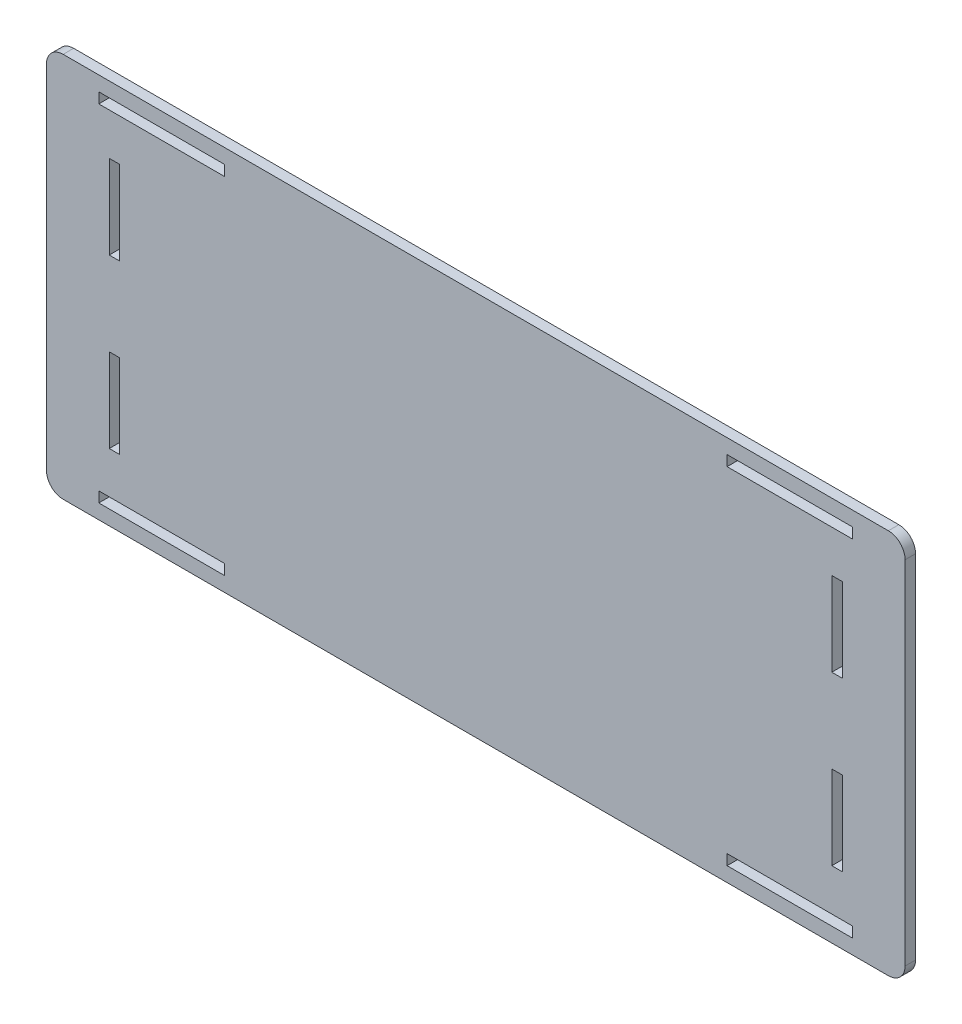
ISO-10303-21;
HEADER;
FILE_DESCRIPTION(('STEP AP214'),'2;1');
FILE_NAME('part.step','',(''),(''),'','','');
FILE_SCHEMA(('AUTOMOTIVE_DESIGN { 1 0 10303 214 1 1 1 1 }'));
ENDSEC;
DATA;
#1=APPLICATION_CONTEXT('core data for automotive mechanical design processes');
#2=APPLICATION_PROTOCOL_DEFINITION('international standard','automotive_design',2000,#1);
#3=PRODUCT_CONTEXT('',#1,'mechanical');
#4=PRODUCT('Part','Part','',(#3));
#5=PRODUCT_RELATED_PRODUCT_CATEGORY('part','',(#4));
#6=PRODUCT_DEFINITION_FORMATION('','',#4);
#7=PRODUCT_DEFINITION_CONTEXT('part definition',#1,'design');
#8=PRODUCT_DEFINITION('design','',#6,#7);
#9=PRODUCT_DEFINITION_SHAPE('','',#8);
#10=(LENGTH_UNIT() NAMED_UNIT(*) SI_UNIT(.MILLI.,.METRE.));
#11=(NAMED_UNIT(*) PLANE_ANGLE_UNIT() SI_UNIT($,.RADIAN.));
#12=(NAMED_UNIT(*) SI_UNIT($,.STERADIAN.) SOLID_ANGLE_UNIT());
#13=UNCERTAINTY_MEASURE_WITH_UNIT(LENGTH_MEASURE(1.E-05),#10,'distance_accuracy_value','');
#14=(GEOMETRIC_REPRESENTATION_CONTEXT(3) GLOBAL_UNCERTAINTY_ASSIGNED_CONTEXT((#13)) GLOBAL_UNIT_ASSIGNED_CONTEXT((#10,
#11,#12)) REPRESENTATION_CONTEXT('',''));
#15=CARTESIAN_POINT('',(0.,0.,0.));
#16=DIRECTION('',(0.,0.,1.));
#17=DIRECTION('',(1.,0.,0.));
#18=AXIS2_PLACEMENT_3D('',#15,#16,#17);
#19=CARTESIAN_POINT('',(0.,12.7,3.175));
#20=DIRECTION('',(0.,-1.,0.));
#21=DIRECTION('',(1.,0.,0.));
#22=AXIS2_PLACEMENT_3D('',#19,#20,#21);
#23=PLANE('',#22);
#24=DIRECTION('',(-1.,0.,0.));
#25=VECTOR('',#24,1.);
#26=CARTESIAN_POINT('',(0.,12.7,0.));
#27=LINE('',#26,#25);
#28=CARTESIAN_POINT('',(-107.95,12.6999999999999,0.));
#29=VERTEX_POINT('',#28);
#30=CARTESIAN_POINT('',(-111.125,12.6999999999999,0.));
#31=VERTEX_POINT('',#30);
#32=EDGE_CURVE('E508',#29,#31,#27,.T.);
#33=ORIENTED_EDGE('',*,*,#32,.T.);
#34=DIRECTION('',(0.,0.,-1.));
#35=VECTOR('',#34,1.);
#36=CARTESIAN_POINT('',(-111.125,12.6999999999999,3.175));
#37=LINE('',#36,#35);
#38=CARTESIAN_POINT('',(-111.125,12.6999999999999,3.175));
#39=VERTEX_POINT('',#38);
#40=EDGE_CURVE('E523',#39,#31,#37,.T.);
#41=ORIENTED_EDGE('',*,*,#40,.F.);
#42=DIRECTION('',(-1.,0.,0.));
#43=VECTOR('',#42,1.);
#44=CARTESIAN_POINT('',(0.,12.7,3.175));
#45=LINE('',#44,#43);
#46=CARTESIAN_POINT('',(-107.95,12.6999999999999,3.175));
#47=VERTEX_POINT('',#46);
#48=EDGE_CURVE('E404',#47,#39,#45,.T.);
#49=ORIENTED_EDGE('',*,*,#48,.F.);
#50=DIRECTION('',(0.,0.,-1.));
#51=VECTOR('',#50,1.);
#52=CARTESIAN_POINT('',(-107.95,12.6999999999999,3.175));
#53=LINE('',#52,#51);
#54=EDGE_CURVE('E516',#47,#29,#53,.T.);
#55=ORIENTED_EDGE('',*,*,#54,.T.);
#56=EDGE_LOOP('',(#33,#41,#49,#55));
#57=FACE_BOUND('',#56,.T.);
#58=ADVANCED_FACE('F35',(#57),#23,.F.);
#59=CARTESIAN_POINT('',(-111.125,-2.42861286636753E-13,3.175));
#60=DIRECTION('',(-1.,0.,0.));
#61=DIRECTION('',(0.,-1.,0.));
#62=AXIS2_PLACEMENT_3D('',#59,#60,#61);
#63=PLANE('',#62);
#64=DIRECTION('',(0.,1.,0.));
#65=VECTOR('',#64,1.);
#66=CARTESIAN_POINT('',(-111.125,-2.42861286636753E-13,0.));
#67=LINE('',#66,#65);
#68=CARTESIAN_POINT('',(-111.125,38.0999999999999,0.));
#69=VERTEX_POINT('',#68);
#70=EDGE_CURVE('E511',#31,#69,#67,.T.);
#71=ORIENTED_EDGE('',*,*,#70,.T.);
#72=DIRECTION('',(0.,0.,-1.));
#73=VECTOR('',#72,1.);
#74=CARTESIAN_POINT('',(-111.125,38.0999999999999,3.175));
#75=LINE('',#74,#73);
#76=CARTESIAN_POINT('',(-111.125,38.0999999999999,3.175));
#77=VERTEX_POINT('',#76);
#78=EDGE_CURVE('E521',#77,#69,#75,.T.);
#79=ORIENTED_EDGE('',*,*,#78,.F.);
#80=DIRECTION('',(0.,1.,0.));
#81=VECTOR('',#80,1.);
#82=CARTESIAN_POINT('',(-111.125,-2.42861286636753E-13,3.175));
#83=LINE('',#82,#81);
#84=EDGE_CURVE('E407',#39,#77,#83,.T.);
#85=ORIENTED_EDGE('',*,*,#84,.F.);
#86=ORIENTED_EDGE('',*,*,#40,.T.);
#87=EDGE_LOOP('',(#71,#79,#85,#86));
#88=FACE_BOUND('',#87,.T.);
#89=ADVANCED_FACE('F651',(#88),#63,.F.);
#90=CARTESIAN_POINT('',(0.,38.0999999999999,3.175));
#91=DIRECTION('',(0.,-1.,0.));
#92=DIRECTION('',(0.,0.,-1.));
#93=AXIS2_PLACEMENT_3D('',#90,#91,#92);
#94=PLANE('',#93);
#95=DIRECTION('',(-1.,0.,0.));
#96=VECTOR('',#95,1.);
#97=CARTESIAN_POINT('',(0.,38.0999999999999,0.));
#98=LINE('',#97,#96);
#99=CARTESIAN_POINT('',(-107.95,38.0999999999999,0.));
#100=VERTEX_POINT('',#99);
#101=EDGE_CURVE('E322',#100,#69,#98,.T.);
#102=ORIENTED_EDGE('',*,*,#101,.F.);
#103=DIRECTION('',(0.,0.,-1.));
#104=VECTOR('',#103,1.);
#105=CARTESIAN_POINT('',(-107.95,38.0999999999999,3.175));
#106=LINE('',#105,#104);
#107=CARTESIAN_POINT('',(-107.95,38.0999999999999,3.175));
#108=VERTEX_POINT('',#107);
#109=EDGE_CURVE('E518',#108,#100,#106,.T.);
#110=ORIENTED_EDGE('',*,*,#109,.F.);
#111=DIRECTION('',(-1.,0.,0.));
#112=VECTOR('',#111,1.);
#113=CARTESIAN_POINT('',(0.,38.0999999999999,3.175));
#114=LINE('',#113,#112);
#115=EDGE_CURVE('E409',#108,#77,#114,.T.);
#116=ORIENTED_EDGE('',*,*,#115,.T.);
#117=ORIENTED_EDGE('',*,*,#78,.T.);
#118=EDGE_LOOP('',(#102,#110,#116,#117));
#119=FACE_BOUND('',#118,.T.);
#120=ADVANCED_FACE('F657',(#119),#94,.T.);
#121=CARTESIAN_POINT('',(0.,50.8,3.175));
#122=DIRECTION('',(0.,-1.,0.));
#123=DIRECTION('',(1.,0.,0.));
#124=AXIS2_PLACEMENT_3D('',#121,#122,#123);
#125=PLANE('',#124);
#126=DIRECTION('',(-1.,0.,0.));
#127=VECTOR('',#126,1.);
#128=CARTESIAN_POINT('',(0.,50.8,0.));
#129=LINE('',#128,#127);
#130=CARTESIAN_POINT('',(-76.2000000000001,50.7999999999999,0.));
#131=VERTEX_POINT('',#130);
#132=CARTESIAN_POINT('',(-114.3,50.7999999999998,0.));
#133=VERTEX_POINT('',#132);
#134=EDGE_CURVE('E496',#131,#133,#129,.T.);
#135=ORIENTED_EDGE('',*,*,#134,.T.);
#136=DIRECTION('',(0.,0.,-1.));
#137=VECTOR('',#136,1.);
#138=CARTESIAN_POINT('',(-114.3,50.7999999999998,3.175));
#139=LINE('',#138,#137);
#140=CARTESIAN_POINT('',(-114.3,50.7999999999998,3.175));
#141=VERTEX_POINT('',#140);
#142=EDGE_CURVE('E519',#141,#133,#139,.T.);
#143=ORIENTED_EDGE('',*,*,#142,.F.);
#144=DIRECTION('',(-1.,0.,0.));
#145=VECTOR('',#144,1.);
#146=CARTESIAN_POINT('',(0.,50.8,3.175));
#147=LINE('',#146,#145);
#148=CARTESIAN_POINT('',(-76.2000000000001,50.7999999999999,3.175));
#149=VERTEX_POINT('',#148);
#150=EDGE_CURVE('E393',#149,#141,#147,.T.);
#151=ORIENTED_EDGE('',*,*,#150,.F.);
#152=DIRECTION('',(0.,0.,-1.));
#153=VECTOR('',#152,1.);
#154=CARTESIAN_POINT('',(-76.2000000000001,50.7999999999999,3.175));
#155=LINE('',#154,#153);
#156=EDGE_CURVE('E527',#149,#131,#155,.T.);
#157=ORIENTED_EDGE('',*,*,#156,.T.);
#158=EDGE_LOOP('',(#135,#143,#151,#157));
#159=FACE_BOUND('',#158,.T.);
#160=ADVANCED_FACE('F676',(#159),#125,.F.);
#161=CARTESIAN_POINT('',(-114.3,-4.9960036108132E-13,3.175));
#162=DIRECTION('',(-1.,0.,0.));
#163=DIRECTION('',(0.,-1.,0.));
#164=AXIS2_PLACEMENT_3D('',#161,#162,#163);
#165=PLANE('',#164);
#166=DIRECTION('',(0.,1.,0.));
#167=VECTOR('',#166,1.);
#168=CARTESIAN_POINT('',(-114.3,-4.9960036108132E-13,0.));
#169=LINE('',#168,#167);
#170=CARTESIAN_POINT('',(-114.3,53.9749999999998,0.));
#171=VERTEX_POINT('',#170);
#172=EDGE_CURVE('E499',#133,#171,#169,.T.);
#173=ORIENTED_EDGE('',*,*,#172,.T.);
#174=DIRECTION('',(0.,0.,-1.));
#175=VECTOR('',#174,1.);
#176=CARTESIAN_POINT('',(-114.3,53.9749999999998,3.175));
#177=LINE('',#176,#175);
#178=CARTESIAN_POINT('',(-114.3,53.9749999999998,3.175));
#179=VERTEX_POINT('',#178);
#180=EDGE_CURVE('E532',#179,#171,#177,.T.);
#181=ORIENTED_EDGE('',*,*,#180,.F.);
#182=DIRECTION('',(0.,1.,0.));
#183=VECTOR('',#182,1.);
#184=CARTESIAN_POINT('',(-114.3,-4.9960036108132E-13,3.175));
#185=LINE('',#184,#183);
#186=EDGE_CURVE('E396',#141,#179,#185,.T.);
#187=ORIENTED_EDGE('',*,*,#186,.F.);
#188=ORIENTED_EDGE('',*,*,#142,.T.);
#189=EDGE_LOOP('',(#173,#181,#187,#188));
#190=FACE_BOUND('',#189,.T.);
#191=ADVANCED_FACE('F672',(#190),#165,.F.);
#192=CARTESIAN_POINT('',(0.,53.975,3.175));
#193=DIRECTION('',(0.,-1.,0.));
#194=DIRECTION('',(1.,0.,0.));
#195=AXIS2_PLACEMENT_3D('',#192,#193,#194);
#196=PLANE('',#195);
#197=DIRECTION('',(-1.,0.,0.));
#198=VECTOR('',#197,1.);
#199=CARTESIAN_POINT('',(0.,53.975,0.));
#200=LINE('',#199,#198);
#201=CARTESIAN_POINT('',(-76.2000000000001,53.9749999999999,0.));
#202=VERTEX_POINT('',#201);
#203=EDGE_CURVE('E502',#202,#171,#200,.T.);
#204=ORIENTED_EDGE('',*,*,#203,.F.);
#205=DIRECTION('',(0.,0.,-1.));
#206=VECTOR('',#205,1.);
#207=CARTESIAN_POINT('',(-76.2000000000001,53.9749999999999,3.175));
#208=LINE('',#207,#206);
#209=CARTESIAN_POINT('',(-76.2000000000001,53.9749999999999,3.175));
#210=VERTEX_POINT('',#209);
#211=EDGE_CURVE('E529',#210,#202,#208,.T.);
#212=ORIENTED_EDGE('',*,*,#211,.F.);
#213=DIRECTION('',(-1.,0.,0.));
#214=VECTOR('',#213,1.);
#215=CARTESIAN_POINT('',(0.,53.975,3.175));
#216=LINE('',#215,#214);
#217=EDGE_CURVE('E398',#210,#179,#216,.T.);
#218=ORIENTED_EDGE('',*,*,#217,.T.);
#219=ORIENTED_EDGE('',*,*,#180,.T.);
#220=EDGE_LOOP('',(#204,#212,#218,#219));
#221=FACE_BOUND('',#220,.T.);
#222=ADVANCED_FACE('F668',(#221),#196,.T.);
#223=CARTESIAN_POINT('',(0.,-12.7,3.175));
#224=DIRECTION('',(0.,1.,0.));
#225=DIRECTION('',(0.,0.,1.));
#226=AXIS2_PLACEMENT_3D('',#223,#224,#225);
#227=PLANE('',#226);
#228=DIRECTION('',(1.,0.,0.));
#229=VECTOR('',#228,1.);
#230=CARTESIAN_POINT('',(0.,-12.7,0.));
#231=LINE('',#230,#229);
#232=CARTESIAN_POINT('',(107.95,-12.7,0.));
#233=VERTEX_POINT('',#232);
#234=CARTESIAN_POINT('',(111.125,-12.7,0.));
#235=VERTEX_POINT('',#234);
#236=EDGE_CURVE('E484',#233,#235,#231,.T.);
#237=ORIENTED_EDGE('',*,*,#236,.T.);
#238=DIRECTION('',(0.,0.,-1.));
#239=VECTOR('',#238,1.);
#240=CARTESIAN_POINT('',(111.125,-12.7,3.175));
#241=LINE('',#240,#239);
#242=CARTESIAN_POINT('',(111.125,-12.7,3.175));
#243=VERTEX_POINT('',#242);
#244=EDGE_CURVE('E530',#243,#235,#241,.T.);
#245=ORIENTED_EDGE('',*,*,#244,.F.);
#246=DIRECTION('',(1.,0.,0.));
#247=VECTOR('',#246,1.);
#248=CARTESIAN_POINT('',(0.,-12.7,3.175));
#249=LINE('',#248,#247);
#250=CARTESIAN_POINT('',(107.95,-12.7,3.175));
#251=VERTEX_POINT('',#250);
#252=EDGE_CURVE('E382',#251,#243,#249,.T.);
#253=ORIENTED_EDGE('',*,*,#252,.F.);
#254=DIRECTION('',(0.,0.,-1.));
#255=VECTOR('',#254,1.);
#256=CARTESIAN_POINT('',(107.95,-12.7,3.175));
#257=LINE('',#256,#255);
#258=EDGE_CURVE('E536',#251,#233,#257,.T.);
#259=ORIENTED_EDGE('',*,*,#258,.T.);
#260=EDGE_LOOP('',(#237,#245,#253,#259));
#261=FACE_BOUND('',#260,.T.);
#262=ADVANCED_FACE('F671',(#261),#227,.F.);
#263=CARTESIAN_POINT('',(111.125,0.,3.175));
#264=DIRECTION('',(1.,0.,0.));
#265=DIRECTION('',(0.,0.,-1.));
#266=AXIS2_PLACEMENT_3D('',#263,#264,#265);
#267=PLANE('',#266);
#268=DIRECTION('',(0.,-1.,0.));
#269=VECTOR('',#268,1.);
#270=CARTESIAN_POINT('',(111.125,0.,0.));
#271=LINE('',#270,#269);
#272=CARTESIAN_POINT('',(111.125,-38.1,0.));
#273=VERTEX_POINT('',#272);
#274=EDGE_CURVE('E487',#235,#273,#271,.T.);
#275=ORIENTED_EDGE('',*,*,#274,.T.);
#276=DIRECTION('',(0.,0.,-1.));
#277=VECTOR('',#276,1.);
#278=CARTESIAN_POINT('',(111.125,-38.1,3.175));
#279=LINE('',#278,#277);
#280=CARTESIAN_POINT('',(111.125,-38.1,3.175));
#281=VERTEX_POINT('',#280);
#282=EDGE_CURVE('E541',#281,#273,#279,.T.);
#283=ORIENTED_EDGE('',*,*,#282,.F.);
#284=DIRECTION('',(0.,-1.,0.));
#285=VECTOR('',#284,1.);
#286=CARTESIAN_POINT('',(111.125,0.,3.175));
#287=LINE('',#286,#285);
#288=EDGE_CURVE('E385',#243,#281,#287,.T.);
#289=ORIENTED_EDGE('',*,*,#288,.F.);
#290=ORIENTED_EDGE('',*,*,#244,.T.);
#291=EDGE_LOOP('',(#275,#283,#289,#290));
#292=FACE_BOUND('',#291,.T.);
#293=ADVANCED_FACE('F689',(#292),#267,.F.);
#294=CARTESIAN_POINT('',(0.,-38.1,3.175));
#295=DIRECTION('',(0.,1.,0.));
#296=DIRECTION('',(0.,0.,1.));
#297=AXIS2_PLACEMENT_3D('',#294,#295,#296);
#298=PLANE('',#297);
#299=DIRECTION('',(1.,0.,0.));
#300=VECTOR('',#299,1.);
#301=CARTESIAN_POINT('',(0.,-38.1,0.));
#302=LINE('',#301,#300);
#303=CARTESIAN_POINT('',(107.95,-38.1,0.));
#304=VERTEX_POINT('',#303);
#305=EDGE_CURVE('E490',#304,#273,#302,.T.);
#306=ORIENTED_EDGE('',*,*,#305,.F.);
#307=DIRECTION('',(0.,0.,-1.));
#308=VECTOR('',#307,1.);
#309=CARTESIAN_POINT('',(107.95,-38.1,3.175));
#310=LINE('',#309,#308);
#311=CARTESIAN_POINT('',(107.95,-38.1,3.175));
#312=VERTEX_POINT('',#311);
#313=EDGE_CURVE('E538',#312,#304,#310,.T.);
#314=ORIENTED_EDGE('',*,*,#313,.F.);
#315=DIRECTION('',(1.,0.,0.));
#316=VECTOR('',#315,1.);
#317=CARTESIAN_POINT('',(0.,-38.1,3.175));
#318=LINE('',#317,#316);
#319=EDGE_CURVE('E387',#312,#281,#318,.T.);
#320=ORIENTED_EDGE('',*,*,#319,.T.);
#321=ORIENTED_EDGE('',*,*,#282,.T.);
#322=EDGE_LOOP('',(#306,#314,#320,#321));
#323=FACE_BOUND('',#322,.T.);
#324=ADVANCED_FACE('F685',(#323),#298,.T.);
#325=CARTESIAN_POINT('',(0.,-50.8,3.175));
#326=DIRECTION('',(0.,1.,0.));
#327=DIRECTION('',(0.,0.,1.));
#328=AXIS2_PLACEMENT_3D('',#325,#326,#327);
#329=PLANE('',#328);
#330=DIRECTION('',(1.,0.,0.));
#331=VECTOR('',#330,1.);
#332=CARTESIAN_POINT('',(0.,-50.8,0.));
#333=LINE('',#332,#331);
#334=CARTESIAN_POINT('',(76.2,-50.8,0.));
#335=VERTEX_POINT('',#334);
#336=CARTESIAN_POINT('',(114.3,-50.8,0.));
#337=VERTEX_POINT('',#336);
#338=EDGE_CURVE('E472',#335,#337,#333,.T.);
#339=ORIENTED_EDGE('',*,*,#338,.T.);
#340=DIRECTION('',(0.,0.,-1.));
#341=VECTOR('',#340,1.);
#342=CARTESIAN_POINT('',(114.3,-50.8,3.175));
#343=LINE('',#342,#341);
#344=CARTESIAN_POINT('',(114.3,-50.8,3.175));
#345=VERTEX_POINT('',#344);
#346=EDGE_CURVE('E539',#345,#337,#343,.T.);
#347=ORIENTED_EDGE('',*,*,#346,.F.);
#348=DIRECTION('',(1.,0.,0.));
#349=VECTOR('',#348,1.);
#350=CARTESIAN_POINT('',(0.,-50.8,3.175));
#351=LINE('',#350,#349);
#352=CARTESIAN_POINT('',(76.2,-50.8,3.175));
#353=VERTEX_POINT('',#352);
#354=EDGE_CURVE('E371',#353,#345,#351,.T.);
#355=ORIENTED_EDGE('',*,*,#354,.F.);
#356=DIRECTION('',(0.,0.,-1.));
#357=VECTOR('',#356,1.);
#358=CARTESIAN_POINT('',(76.2,-50.8,3.175));
#359=LINE('',#358,#357);
#360=EDGE_CURVE('E545',#353,#335,#359,.T.);
#361=ORIENTED_EDGE('',*,*,#360,.T.);
#362=EDGE_LOOP('',(#339,#347,#355,#361));
#363=FACE_BOUND('',#362,.T.);
#364=ADVANCED_FACE('F688',(#363),#329,.F.);
#365=CARTESIAN_POINT('',(114.3,4.9960036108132E-13,3.175));
#366=DIRECTION('',(1.,0.,0.));
#367=DIRECTION('',(0.,1.,0.));
#368=AXIS2_PLACEMENT_3D('',#365,#366,#367);
#369=PLANE('',#368);
#370=DIRECTION('',(0.,-1.,0.));
#371=VECTOR('',#370,1.);
#372=CARTESIAN_POINT('',(114.3,4.9960036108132E-13,0.));
#373=LINE('',#372,#371);
#374=CARTESIAN_POINT('',(114.3,-53.975,0.));
#375=VERTEX_POINT('',#374);
#376=EDGE_CURVE('E475',#337,#375,#373,.T.);
#377=ORIENTED_EDGE('',*,*,#376,.T.);
#378=DIRECTION('',(0.,0.,-1.));
#379=VECTOR('',#378,1.);
#380=CARTESIAN_POINT('',(114.3,-53.975,3.175));
#381=LINE('',#380,#379);
#382=CARTESIAN_POINT('',(114.3,-53.975,3.175));
#383=VERTEX_POINT('',#382);
#384=EDGE_CURVE('E550',#383,#375,#381,.T.);
#385=ORIENTED_EDGE('',*,*,#384,.F.);
#386=DIRECTION('',(0.,-1.,0.));
#387=VECTOR('',#386,1.);
#388=CARTESIAN_POINT('',(114.3,4.9960036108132E-13,3.175));
#389=LINE('',#388,#387);
#390=EDGE_CURVE('E374',#345,#383,#389,.T.);
#391=ORIENTED_EDGE('',*,*,#390,.F.);
#392=ORIENTED_EDGE('',*,*,#346,.T.);
#393=EDGE_LOOP('',(#377,#385,#391,#392));
#394=FACE_BOUND('',#393,.T.);
#395=ADVANCED_FACE('F703',(#394),#369,.F.);
#396=CARTESIAN_POINT('',(0.,-53.975,3.175));
#397=DIRECTION('',(0.,1.,0.));
#398=DIRECTION('',(0.,0.,1.));
#399=AXIS2_PLACEMENT_3D('',#396,#397,#398);
#400=PLANE('',#399);
#401=DIRECTION('',(1.,0.,0.));
#402=VECTOR('',#401,1.);
#403=CARTESIAN_POINT('',(0.,-53.975,0.));
#404=LINE('',#403,#402);
#405=CARTESIAN_POINT('',(76.2,-53.975,0.));
#406=VERTEX_POINT('',#405);
#407=EDGE_CURVE('E478',#406,#375,#404,.T.);
#408=ORIENTED_EDGE('',*,*,#407,.F.);
#409=DIRECTION('',(0.,0.,-1.));
#410=VECTOR('',#409,1.);
#411=CARTESIAN_POINT('',(76.2,-53.975,3.175));
#412=LINE('',#411,#410);
#413=CARTESIAN_POINT('',(76.2,-53.975,3.175));
#414=VERTEX_POINT('',#413);
#415=EDGE_CURVE('E547',#414,#406,#412,.T.);
#416=ORIENTED_EDGE('',*,*,#415,.F.);
#417=DIRECTION('',(1.,0.,0.));
#418=VECTOR('',#417,1.);
#419=CARTESIAN_POINT('',(0.,-53.975,3.175));
#420=LINE('',#419,#418);
#421=EDGE_CURVE('E376',#414,#383,#420,.T.);
#422=ORIENTED_EDGE('',*,*,#421,.T.);
#423=ORIENTED_EDGE('',*,*,#384,.T.);
#424=EDGE_LOOP('',(#408,#416,#422,#423));
#425=FACE_BOUND('',#424,.T.);
#426=ADVANCED_FACE('F700',(#425),#400,.T.);
#427=CARTESIAN_POINT('',(130.175,0.,3.175));
#428=DIRECTION('',(1.,0.,0.));
#429=DIRECTION('',(0.,1.,0.));
#430=AXIS2_PLACEMENT_3D('',#427,#428,#429);
#431=PLANE('',#430);
#432=DIRECTION('',(0.,-1.,0.));
#433=VECTOR('',#432,1.);
#434=CARTESIAN_POINT('',(130.175,0.,3.175));
#435=LINE('',#434,#433);
#436=CARTESIAN_POINT('',(130.175,53.34,3.175));
#437=VERTEX_POINT('',#436);
#438=CARTESIAN_POINT('',(130.175,-53.34,3.175));
#439=VERTEX_POINT('',#438);
#440=EDGE_CURVE('E360',#437,#439,#435,.T.);
#441=ORIENTED_EDGE('',*,*,#440,.T.);
#442=DIRECTION('',(0.,0.,-1.));
#443=VECTOR('',#442,1.);
#444=CARTESIAN_POINT('',(130.175,-53.34,0.));
#445=LINE('',#444,#443);
#446=CARTESIAN_POINT('',(130.175,-53.34,0.));
#447=VERTEX_POINT('',#446);
#448=EDGE_CURVE('E584',#439,#447,#445,.T.);
#449=ORIENTED_EDGE('',*,*,#448,.T.);
#450=DIRECTION('',(0.,-1.,0.));
#451=VECTOR('',#450,1.);
#452=CARTESIAN_POINT('',(130.175,0.,0.));
#453=LINE('',#452,#451);
#454=CARTESIAN_POINT('',(130.175,53.34,0.));
#455=VERTEX_POINT('',#454);
#456=EDGE_CURVE('E461',#455,#447,#453,.T.);
#457=ORIENTED_EDGE('',*,*,#456,.F.);
#458=DIRECTION('',(0.,0.,-1.));
#459=VECTOR('',#458,1.);
#460=CARTESIAN_POINT('',(130.175,53.34,3.175));
#461=LINE('',#460,#459);
#462=EDGE_CURVE('E526',#455,#437,#461,.F.);
#463=ORIENTED_EDGE('',*,*,#462,.T.);
#464=EDGE_LOOP('',(#441,#449,#457,#463));
#465=FACE_BOUND('',#464,.T.);
#466=ADVANCED_FACE('F640',(#465),#431,.T.);
#467=CARTESIAN_POINT('',(0.,58.42,3.175));
#468=DIRECTION('',(0.,1.,0.));
#469=DIRECTION('',(0.,0.,1.));
#470=AXIS2_PLACEMENT_3D('',#467,#468,#469);
#471=PLANE('',#470);
#472=DIRECTION('',(1.,0.,0.));
#473=VECTOR('',#472,1.);
#474=CARTESIAN_POINT('',(0.,58.42,3.175));
#475=LINE('',#474,#473);
#476=CARTESIAN_POINT('',(-125.095,58.42,3.175));
#477=VERTEX_POINT('',#476);
#478=CARTESIAN_POINT('',(125.095,58.42,3.175));
#479=VERTEX_POINT('',#478);
#480=EDGE_CURVE('E363',#477,#479,#475,.T.);
#481=ORIENTED_EDGE('',*,*,#480,.T.);
#482=DIRECTION('',(0.,0.,-1.));
#483=VECTOR('',#482,1.);
#484=CARTESIAN_POINT('',(125.095,58.42,3.175));
#485=LINE('',#484,#483);
#486=CARTESIAN_POINT('',(125.095,58.42,0.));
#487=VERTEX_POINT('',#486);
#488=EDGE_CURVE('E11',#479,#487,#485,.T.);
#489=ORIENTED_EDGE('',*,*,#488,.T.);
#490=DIRECTION('',(1.,0.,0.));
#491=VECTOR('',#490,1.);
#492=CARTESIAN_POINT('',(0.,58.42,0.));
#493=LINE('',#492,#491);
#494=CARTESIAN_POINT('',(-125.095,58.42,0.));
#495=VERTEX_POINT('',#494);
#496=EDGE_CURVE('E464',#495,#487,#493,.T.);
#497=ORIENTED_EDGE('',*,*,#496,.F.);
#498=DIRECTION('',(0.,0.,-1.));
#499=VECTOR('',#498,1.);
#500=CARTESIAN_POINT('',(-125.095,58.42,3.175));
#501=LINE('',#500,#499);
#502=EDGE_CURVE('E43',#495,#477,#501,.F.);
#503=ORIENTED_EDGE('',*,*,#502,.T.);
#504=EDGE_LOOP('',(#481,#489,#497,#503));
#505=FACE_BOUND('',#504,.T.);
#506=ADVANCED_FACE('F613',(#505),#471,.T.);
#507=CARTESIAN_POINT('',(-130.175,0.,3.175));
#508=DIRECTION('',(1.,0.,0.));
#509=DIRECTION('',(0.,1.,0.));
#510=AXIS2_PLACEMENT_3D('',#507,#508,#509);
#511=PLANE('',#510);
#512=DIRECTION('',(0.,-1.,0.));
#513=VECTOR('',#512,1.);
#514=CARTESIAN_POINT('',(-130.175,0.,0.));
#515=LINE('',#514,#513);
#516=CARTESIAN_POINT('',(-130.175,53.34,0.));
#517=VERTEX_POINT('',#516);
#518=CARTESIAN_POINT('',(-130.175,-53.34,0.));
#519=VERTEX_POINT('',#518);
#520=EDGE_CURVE('E467',#517,#519,#515,.T.);
#521=ORIENTED_EDGE('',*,*,#520,.T.);
#522=DIRECTION('',(0.,0.,-1.));
#523=VECTOR('',#522,1.);
#524=CARTESIAN_POINT('',(-130.175,-53.34,3.175));
#525=LINE('',#524,#523);
#526=CARTESIAN_POINT('',(-130.175,-53.34,3.175));
#527=VERTEX_POINT('',#526);
#528=EDGE_CURVE('E50',#519,#527,#525,.F.);
#529=ORIENTED_EDGE('',*,*,#528,.T.);
#530=DIRECTION('',(0.,-1.,0.));
#531=VECTOR('',#530,1.);
#532=CARTESIAN_POINT('',(-130.175,0.,3.175));
#533=LINE('',#532,#531);
#534=CARTESIAN_POINT('',(-130.175,53.34,3.175));
#535=VERTEX_POINT('',#534);
#536=EDGE_CURVE('E366',#535,#527,#533,.T.);
#537=ORIENTED_EDGE('',*,*,#536,.F.);
#538=DIRECTION('',(0.,0.,-1.));
#539=VECTOR('',#538,1.);
#540=CARTESIAN_POINT('',(-130.175,53.34,0.));
#541=LINE('',#540,#539);
#542=EDGE_CURVE('E607',#535,#517,#541,.T.);
#543=ORIENTED_EDGE('',*,*,#542,.T.);
#544=EDGE_LOOP('',(#521,#529,#537,#543));
#545=FACE_BOUND('',#544,.T.);
#546=ADVANCED_FACE('F621',(#545),#511,.F.);
#547=CARTESIAN_POINT('',(0.,12.7,3.175));
#548=DIRECTION('',(0.,1.,0.));
#549=DIRECTION('',(-1.,0.,0.));
#550=AXIS2_PLACEMENT_3D('',#547,#548,#549);
#551=PLANE('',#550);
#552=DIRECTION('',(1.,0.,0.));
#553=VECTOR('',#552,1.);
#554=CARTESIAN_POINT('',(0.,12.7,0.));
#555=LINE('',#554,#553);
#556=CARTESIAN_POINT('',(107.95,12.6999999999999,0.));
#557=VERTEX_POINT('',#556);
#558=CARTESIAN_POINT('',(111.125,12.6999999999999,0.));
#559=VERTEX_POINT('',#558);
#560=EDGE_CURVE('E449',#557,#559,#555,.T.);
#561=ORIENTED_EDGE('',*,*,#560,.F.);
#562=DIRECTION('',(0.,0.,-1.));
#563=VECTOR('',#562,1.);
#564=CARTESIAN_POINT('',(107.95,12.6999999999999,3.175));
#565=LINE('',#564,#563);
#566=CARTESIAN_POINT('',(107.95,12.6999999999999,3.175));
#567=VERTEX_POINT('',#566);
#568=EDGE_CURVE('E548',#567,#557,#565,.T.);
#569=ORIENTED_EDGE('',*,*,#568,.F.);
#570=DIRECTION('',(1.,0.,0.));
#571=VECTOR('',#570,1.);
#572=CARTESIAN_POINT('',(0.,12.7,3.175));
#573=LINE('',#572,#571);
#574=CARTESIAN_POINT('',(111.125,12.6999999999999,3.175));
#575=VERTEX_POINT('',#574);
#576=EDGE_CURVE('E349',#567,#575,#573,.T.);
#577=ORIENTED_EDGE('',*,*,#576,.T.);
#578=DIRECTION('',(0.,0.,-1.));
#579=VECTOR('',#578,1.);
#580=CARTESIAN_POINT('',(111.125,12.6999999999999,3.175));
#581=LINE('',#580,#579);
#582=EDGE_CURVE('E554',#575,#559,#581,.T.);
#583=ORIENTED_EDGE('',*,*,#582,.T.);
#584=EDGE_LOOP('',(#561,#569,#577,#583));
#585=FACE_BOUND('',#584,.T.);
#586=ADVANCED_FACE('F716',(#585),#551,.T.);
#587=CARTESIAN_POINT('',(107.95,-1.17961196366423E-13,3.175));
#588=DIRECTION('',(-1.,0.,0.));
#589=DIRECTION('',(0.,-1.,0.));
#590=AXIS2_PLACEMENT_3D('',#587,#588,#589);
#591=PLANE('',#590);
#592=DIRECTION('',(0.,1.,0.));
#593=VECTOR('',#592,1.);
#594=CARTESIAN_POINT('',(107.95,-1.17961196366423E-13,0.));
#595=LINE('',#594,#593);
#596=CARTESIAN_POINT('',(107.95,38.0999999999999,0.));
#597=VERTEX_POINT('',#596);
#598=EDGE_CURVE('E452',#557,#597,#595,.T.);
#599=ORIENTED_EDGE('',*,*,#598,.T.);
#600=DIRECTION('',(0.,0.,-1.));
#601=VECTOR('',#600,1.);
#602=CARTESIAN_POINT('',(107.95,38.0999999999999,3.175));
#603=LINE('',#602,#601);
#604=CARTESIAN_POINT('',(107.95,38.0999999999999,3.175));
#605=VERTEX_POINT('',#604);
#606=EDGE_CURVE('E559',#605,#597,#603,.T.);
#607=ORIENTED_EDGE('',*,*,#606,.F.);
#608=DIRECTION('',(0.,1.,0.));
#609=VECTOR('',#608,1.);
#610=CARTESIAN_POINT('',(107.95,-1.17961196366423E-13,3.175));
#611=LINE('',#610,#609);
#612=EDGE_CURVE('E352',#567,#605,#611,.T.);
#613=ORIENTED_EDGE('',*,*,#612,.F.);
#614=ORIENTED_EDGE('',*,*,#568,.T.);
#615=EDGE_LOOP('',(#599,#607,#613,#614));
#616=FACE_BOUND('',#615,.T.);
#617=ADVANCED_FACE('F729',(#616),#591,.F.);
#618=CARTESIAN_POINT('',(0.,38.0999999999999,3.175));
#619=DIRECTION('',(0.,1.,0.));
#620=DIRECTION('',(0.,0.,1.));
#621=AXIS2_PLACEMENT_3D('',#618,#619,#620);
#622=PLANE('',#621);
#623=DIRECTION('',(1.,0.,0.));
#624=VECTOR('',#623,1.);
#625=CARTESIAN_POINT('',(0.,38.0999999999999,0.));
#626=LINE('',#625,#624);
#627=CARTESIAN_POINT('',(111.125,38.0999999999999,0.));
#628=VERTEX_POINT('',#627);
#629=EDGE_CURVE('E455',#597,#628,#626,.T.);
#630=ORIENTED_EDGE('',*,*,#629,.T.);
#631=DIRECTION('',(0.,0.,-1.));
#632=VECTOR('',#631,1.);
#633=CARTESIAN_POINT('',(111.125,38.0999999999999,3.175));
#634=LINE('',#633,#632);
#635=CARTESIAN_POINT('',(111.125,38.0999999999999,3.175));
#636=VERTEX_POINT('',#635);
#637=EDGE_CURVE('E556',#636,#628,#634,.T.);
#638=ORIENTED_EDGE('',*,*,#637,.F.);
#639=DIRECTION('',(1.,0.,0.));
#640=VECTOR('',#639,1.);
#641=CARTESIAN_POINT('',(0.,38.0999999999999,3.175));
#642=LINE('',#641,#640);
#643=EDGE_CURVE('E355',#605,#636,#642,.T.);
#644=ORIENTED_EDGE('',*,*,#643,.F.);
#645=ORIENTED_EDGE('',*,*,#606,.T.);
#646=EDGE_LOOP('',(#630,#638,#644,#645));
#647=FACE_BOUND('',#646,.T.);
#648=ADVANCED_FACE('F725',(#647),#622,.F.);
#649=CARTESIAN_POINT('',(0.,50.8,3.175));
#650=DIRECTION('',(0.,1.,0.));
#651=DIRECTION('',(-1.,0.,0.));
#652=AXIS2_PLACEMENT_3D('',#649,#650,#651);
#653=PLANE('',#652);
#654=DIRECTION('',(1.,0.,0.));
#655=VECTOR('',#654,1.);
#656=CARTESIAN_POINT('',(0.,50.8,0.));
#657=LINE('',#656,#655);
#658=CARTESIAN_POINT('',(76.2,50.7999999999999,0.));
#659=VERTEX_POINT('',#658);
#660=CARTESIAN_POINT('',(114.3,50.7999999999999,0.));
#661=VERTEX_POINT('',#660);
#662=EDGE_CURVE('E437',#659,#661,#657,.T.);
#663=ORIENTED_EDGE('',*,*,#662,.F.);
#664=DIRECTION('',(0.,0.,-1.));
#665=VECTOR('',#664,1.);
#666=CARTESIAN_POINT('',(76.2,50.7999999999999,3.175));
#667=LINE('',#666,#665);
#668=CARTESIAN_POINT('',(76.2,50.7999999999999,3.175));
#669=VERTEX_POINT('',#668);
#670=EDGE_CURVE('E557',#669,#659,#667,.T.);
#671=ORIENTED_EDGE('',*,*,#670,.F.);
#672=DIRECTION('',(1.,0.,0.));
#673=VECTOR('',#672,1.);
#674=CARTESIAN_POINT('',(0.,50.8,3.175));
#675=LINE('',#674,#673);
#676=CARTESIAN_POINT('',(114.3,50.7999999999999,3.175));
#677=VERTEX_POINT('',#676);
#678=EDGE_CURVE('E338',#669,#677,#675,.T.);
#679=ORIENTED_EDGE('',*,*,#678,.T.);
#680=DIRECTION('',(0.,0.,-1.));
#681=VECTOR('',#680,1.);
#682=CARTESIAN_POINT('',(114.3,50.7999999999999,3.175));
#683=LINE('',#682,#681);
#684=EDGE_CURVE('E563',#677,#661,#683,.T.);
#685=ORIENTED_EDGE('',*,*,#684,.T.);
#686=EDGE_LOOP('',(#663,#671,#679,#685));
#687=FACE_BOUND('',#686,.T.);
#688=ADVANCED_FACE('F728',(#687),#653,.T.);
#689=CARTESIAN_POINT('',(76.2,0.,3.175));
#690=DIRECTION('',(-1.,0.,0.));
#691=DIRECTION('',(0.,0.,1.));
#692=AXIS2_PLACEMENT_3D('',#689,#690,#691);
#693=PLANE('',#692);
#694=DIRECTION('',(0.,1.,0.));
#695=VECTOR('',#694,1.);
#696=CARTESIAN_POINT('',(76.2,0.,0.));
#697=LINE('',#696,#695);
#698=CARTESIAN_POINT('',(76.2,53.9749999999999,0.));
#699=VERTEX_POINT('',#698);
#700=EDGE_CURVE('E440',#659,#699,#697,.T.);
#701=ORIENTED_EDGE('',*,*,#700,.T.);
#702=DIRECTION('',(0.,0.,-1.));
#703=VECTOR('',#702,1.);
#704=CARTESIAN_POINT('',(76.2,53.9749999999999,3.175));
#705=LINE('',#704,#703);
#706=CARTESIAN_POINT('',(76.2,53.9749999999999,3.175));
#707=VERTEX_POINT('',#706);
#708=EDGE_CURVE('E568',#707,#699,#705,.T.);
#709=ORIENTED_EDGE('',*,*,#708,.F.);
#710=DIRECTION('',(0.,1.,0.));
#711=VECTOR('',#710,1.);
#712=CARTESIAN_POINT('',(76.2,0.,3.175));
#713=LINE('',#712,#711);
#714=EDGE_CURVE('E341',#669,#707,#713,.T.);
#715=ORIENTED_EDGE('',*,*,#714,.F.);
#716=ORIENTED_EDGE('',*,*,#670,.T.);
#717=EDGE_LOOP('',(#701,#709,#715,#716));
#718=FACE_BOUND('',#717,.T.);
#719=ADVANCED_FACE('F745',(#718),#693,.F.);
#720=CARTESIAN_POINT('',(0.,53.975,3.175));
#721=DIRECTION('',(0.,1.,0.));
#722=DIRECTION('',(-1.,0.,0.));
#723=AXIS2_PLACEMENT_3D('',#720,#721,#722);
#724=PLANE('',#723);
#725=DIRECTION('',(1.,0.,0.));
#726=VECTOR('',#725,1.);
#727=CARTESIAN_POINT('',(0.,53.975,0.));
#728=LINE('',#727,#726);
#729=CARTESIAN_POINT('',(114.3,53.9749999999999,0.));
#730=VERTEX_POINT('',#729);
#731=EDGE_CURVE('E443',#699,#730,#728,.T.);
#732=ORIENTED_EDGE('',*,*,#731,.T.);
#733=DIRECTION('',(0.,0.,-1.));
#734=VECTOR('',#733,1.);
#735=CARTESIAN_POINT('',(114.3,53.9749999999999,3.175));
#736=LINE('',#735,#734);
#737=CARTESIAN_POINT('',(114.3,53.9749999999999,3.175));
#738=VERTEX_POINT('',#737);
#739=EDGE_CURVE('E565',#738,#730,#736,.T.);
#740=ORIENTED_EDGE('',*,*,#739,.F.);
#741=DIRECTION('',(1.,0.,0.));
#742=VECTOR('',#741,1.);
#743=CARTESIAN_POINT('',(0.,53.975,3.175));
#744=LINE('',#743,#742);
#745=EDGE_CURVE('E344',#707,#738,#744,.T.);
#746=ORIENTED_EDGE('',*,*,#745,.F.);
#747=ORIENTED_EDGE('',*,*,#708,.T.);
#748=EDGE_LOOP('',(#732,#740,#746,#747));
#749=FACE_BOUND('',#748,.T.);
#750=ADVANCED_FACE('F741',(#749),#724,.F.);
#751=CARTESIAN_POINT('',(0.,-12.7,3.175));
#752=DIRECTION('',(0.,-1.,0.));
#753=DIRECTION('',(0.,0.,-1.));
#754=AXIS2_PLACEMENT_3D('',#751,#752,#753);
#755=PLANE('',#754);
#756=DIRECTION('',(-1.,0.,0.));
#757=VECTOR('',#756,1.);
#758=CARTESIAN_POINT('',(0.,-12.7,0.));
#759=LINE('',#758,#757);
#760=CARTESIAN_POINT('',(-107.95,-12.7,0.));
#761=VERTEX_POINT('',#760);
#762=CARTESIAN_POINT('',(-111.125,-12.7,0.));
#763=VERTEX_POINT('',#762);
#764=EDGE_CURVE('E425',#761,#763,#759,.T.);
#765=ORIENTED_EDGE('',*,*,#764,.F.);
#766=DIRECTION('',(0.,0.,-1.));
#767=VECTOR('',#766,1.);
#768=CARTESIAN_POINT('',(-107.95,-12.7,3.175));
#769=LINE('',#768,#767);
#770=CARTESIAN_POINT('',(-107.95,-12.7,3.175));
#771=VERTEX_POINT('',#770);
#772=EDGE_CURVE('E566',#771,#761,#769,.T.);
#773=ORIENTED_EDGE('',*,*,#772,.F.);
#774=DIRECTION('',(-1.,0.,0.));
#775=VECTOR('',#774,1.);
#776=CARTESIAN_POINT('',(0.,-12.7,3.175));
#777=LINE('',#776,#775);
#778=CARTESIAN_POINT('',(-111.125,-12.7,3.175));
#779=VERTEX_POINT('',#778);
#780=EDGE_CURVE('E327',#771,#779,#777,.T.);
#781=ORIENTED_EDGE('',*,*,#780,.T.);
#782=DIRECTION('',(0.,0.,-1.));
#783=VECTOR('',#782,1.);
#784=CARTESIAN_POINT('',(-111.125,-12.7,3.175));
#785=LINE('',#784,#783);
#786=EDGE_CURVE('E304',#779,#763,#785,.T.);
#787=ORIENTED_EDGE('',*,*,#786,.T.);
#788=EDGE_LOOP('',(#765,#773,#781,#787));
#789=FACE_BOUND('',#788,.T.);
#790=ADVANCED_FACE('F744',(#789),#755,.T.);
#791=CARTESIAN_POINT('',(-107.95,-1.17961196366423E-13,3.175));
#792=DIRECTION('',(1.,0.,0.));
#793=DIRECTION('',(0.,1.,0.));
#794=AXIS2_PLACEMENT_3D('',#791,#792,#793);
#795=PLANE('',#794);
#796=DIRECTION('',(0.,-1.,0.));
#797=VECTOR('',#796,1.);
#798=CARTESIAN_POINT('',(-107.95,-1.17961196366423E-13,0.));
#799=LINE('',#798,#797);
#800=CARTESIAN_POINT('',(-107.95,-38.1000000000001,0.));
#801=VERTEX_POINT('',#800);
#802=EDGE_CURVE('E428',#761,#801,#799,.T.);
#803=ORIENTED_EDGE('',*,*,#802,.T.);
#804=DIRECTION('',(0.,0.,-1.));
#805=VECTOR('',#804,1.);
#806=CARTESIAN_POINT('',(-107.95,-38.1000000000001,3.175));
#807=LINE('',#806,#805);
#808=CARTESIAN_POINT('',(-107.95,-38.1000000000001,3.175));
#809=VERTEX_POINT('',#808);
#810=EDGE_CURVE('E575',#809,#801,#807,.T.);
#811=ORIENTED_EDGE('',*,*,#810,.F.);
#812=DIRECTION('',(0.,-1.,0.));
#813=VECTOR('',#812,1.);
#814=CARTESIAN_POINT('',(-107.95,-1.17961196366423E-13,3.175));
#815=LINE('',#814,#813);
#816=EDGE_CURVE('E330',#771,#809,#815,.T.);
#817=ORIENTED_EDGE('',*,*,#816,.F.);
#818=ORIENTED_EDGE('',*,*,#772,.T.);
#819=EDGE_LOOP('',(#803,#811,#817,#818));
#820=FACE_BOUND('',#819,.T.);
#821=ADVANCED_FACE('F760',(#820),#795,.F.);
#822=CARTESIAN_POINT('',(0.,-38.1000000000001,3.175));
#823=DIRECTION('',(0.,-1.,0.));
#824=DIRECTION('',(0.,0.,-1.));
#825=AXIS2_PLACEMENT_3D('',#822,#823,#824);
#826=PLANE('',#825);
#827=DIRECTION('',(-1.,0.,0.));
#828=VECTOR('',#827,1.);
#829=CARTESIAN_POINT('',(0.,-38.1000000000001,0.));
#830=LINE('',#829,#828);
#831=CARTESIAN_POINT('',(-111.125,-38.1000000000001,0.));
#832=VERTEX_POINT('',#831);
#833=EDGE_CURVE('E431',#801,#832,#830,.T.);
#834=ORIENTED_EDGE('',*,*,#833,.T.);
#835=DIRECTION('',(0.,0.,-1.));
#836=VECTOR('',#835,1.);
#837=CARTESIAN_POINT('',(-111.125,-38.1000000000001,3.175));
#838=LINE('',#837,#836);
#839=CARTESIAN_POINT('',(-111.125,-38.1000000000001,3.175));
#840=VERTEX_POINT('',#839);
#841=EDGE_CURVE('E573',#840,#832,#838,.T.);
#842=ORIENTED_EDGE('',*,*,#841,.F.);
#843=DIRECTION('',(-1.,0.,0.));
#844=VECTOR('',#843,1.);
#845=CARTESIAN_POINT('',(0.,-38.1000000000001,3.175));
#846=LINE('',#845,#844);
#847=EDGE_CURVE('E333',#809,#840,#846,.T.);
#848=ORIENTED_EDGE('',*,*,#847,.F.);
#849=ORIENTED_EDGE('',*,*,#810,.T.);
#850=EDGE_LOOP('',(#834,#842,#848,#849));
#851=FACE_BOUND('',#850,.T.);
#852=ADVANCED_FACE('F757',(#851),#826,.F.);
#853=CARTESIAN_POINT('',(0.,-50.8,3.175));
#854=DIRECTION('',(0.,-1.,0.));
#855=DIRECTION('',(1.,0.,0.));
#856=AXIS2_PLACEMENT_3D('',#853,#854,#855);
#857=PLANE('',#856);
#858=DIRECTION('',(-1.,0.,0.));
#859=VECTOR('',#858,1.);
#860=CARTESIAN_POINT('',(0.,-50.8,0.));
#861=LINE('',#860,#859);
#862=CARTESIAN_POINT('',(-76.2,-50.8,0.));
#863=VERTEX_POINT('',#862);
#864=CARTESIAN_POINT('',(-114.3,-50.8000000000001,0.));
#865=VERTEX_POINT('',#864);
#866=EDGE_CURVE('E301',#863,#865,#861,.T.);
#867=ORIENTED_EDGE('',*,*,#866,.F.);
#868=DIRECTION('',(0.,0.,-1.));
#869=VECTOR('',#868,1.);
#870=CARTESIAN_POINT('',(-76.2,-50.8,3.175));
#871=LINE('',#870,#869);
#872=CARTESIAN_POINT('',(-76.2,-50.8,3.175));
#873=VERTEX_POINT('',#872);
#874=EDGE_CURVE('E294',#873,#863,#871,.T.);
#875=ORIENTED_EDGE('',*,*,#874,.F.);
#876=DIRECTION('',(-1.,0.,0.));
#877=VECTOR('',#876,1.);
#878=CARTESIAN_POINT('',(0.,-50.8,3.175));
#879=LINE('',#878,#877);
#880=CARTESIAN_POINT('',(-114.3,-50.8000000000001,3.175));
#881=VERTEX_POINT('',#880);
#882=EDGE_CURVE('E298',#873,#881,#879,.T.);
#883=ORIENTED_EDGE('',*,*,#882,.T.);
#884=DIRECTION('',(0.,0.,-1.));
#885=VECTOR('',#884,1.);
#886=CARTESIAN_POINT('',(-114.3,-50.8000000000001,3.175));
#887=LINE('',#886,#885);
#888=EDGE_CURVE('E415',#881,#865,#887,.T.);
#889=ORIENTED_EDGE('',*,*,#888,.T.);
#890=EDGE_LOOP('',(#867,#875,#883,#889));
#891=FACE_BOUND('',#890,.T.);
#892=ADVANCED_FACE('F296',(#891),#857,.T.);
#893=CARTESIAN_POINT('',(-76.2,0.,3.175));
#894=DIRECTION('',(1.,0.,0.));
#895=DIRECTION('',(0.,0.,-1.));
#896=AXIS2_PLACEMENT_3D('',#893,#894,#895);
#897=PLANE('',#896);
#898=DIRECTION('',(0.,-1.,0.));
#899=VECTOR('',#898,1.);
#900=CARTESIAN_POINT('',(-76.2,0.,0.));
#901=LINE('',#900,#899);
#902=CARTESIAN_POINT('',(-76.2,-53.975,0.));
#903=VERTEX_POINT('',#902);
#904=EDGE_CURVE('E417',#863,#903,#901,.T.);
#905=ORIENTED_EDGE('',*,*,#904,.T.);
#906=DIRECTION('',(0.,0.,-1.));
#907=VECTOR('',#906,1.);
#908=CARTESIAN_POINT('',(-76.2,-53.975,3.175));
#909=LINE('',#908,#907);
#910=CARTESIAN_POINT('',(-76.2,-53.975,3.175));
#911=VERTEX_POINT('',#910);
#912=EDGE_CURVE('E305',#911,#903,#909,.T.);
#913=ORIENTED_EDGE('',*,*,#912,.F.);
#914=DIRECTION('',(0.,-1.,0.));
#915=VECTOR('',#914,1.);
#916=CARTESIAN_POINT('',(-76.2,0.,3.175));
#917=LINE('',#916,#915);
#918=EDGE_CURVE('E308',#873,#911,#917,.T.);
#919=ORIENTED_EDGE('',*,*,#918,.F.);
#920=ORIENTED_EDGE('',*,*,#874,.T.);
#921=EDGE_LOOP('',(#905,#913,#919,#920));
#922=FACE_BOUND('',#921,.T.);
#923=ADVANCED_FACE('F309',(#922),#897,.F.);
#924=CARTESIAN_POINT('',(0.,-53.975,3.175));
#925=DIRECTION('',(0.,-1.,0.));
#926=DIRECTION('',(1.,0.,0.));
#927=AXIS2_PLACEMENT_3D('',#924,#925,#926);
#928=PLANE('',#927);
#929=DIRECTION('',(-1.,0.,0.));
#930=VECTOR('',#929,1.);
#931=CARTESIAN_POINT('',(0.,-53.975,0.));
#932=LINE('',#931,#930);
#933=CARTESIAN_POINT('',(-114.3,-53.9750000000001,0.));
#934=VERTEX_POINT('',#933);
#935=EDGE_CURVE('E419',#903,#934,#932,.T.);
#936=ORIENTED_EDGE('',*,*,#935,.T.);
#937=DIRECTION('',(0.,0.,-1.));
#938=VECTOR('',#937,1.);
#939=CARTESIAN_POINT('',(-114.3,-53.9750000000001,3.175));
#940=LINE('',#939,#938);
#941=CARTESIAN_POINT('',(-114.3,-53.9750000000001,3.175));
#942=VERTEX_POINT('',#941);
#943=EDGE_CURVE('E580',#942,#934,#940,.T.);
#944=ORIENTED_EDGE('',*,*,#943,.F.);
#945=DIRECTION('',(-1.,0.,0.));
#946=VECTOR('',#945,1.);
#947=CARTESIAN_POINT('',(0.,-53.975,3.175));
#948=LINE('',#947,#946);
#949=EDGE_CURVE('E313',#911,#942,#948,.T.);
#950=ORIENTED_EDGE('',*,*,#949,.F.);
#951=ORIENTED_EDGE('',*,*,#912,.T.);
#952=EDGE_LOOP('',(#936,#944,#950,#951));
#953=FACE_BOUND('',#952,.T.);
#954=ADVANCED_FACE('F666',(#953),#928,.F.);
#955=CARTESIAN_POINT('',(-76.2000000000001,0.,3.175));
#956=DIRECTION('',(-1.,0.,0.));
#957=DIRECTION('',(0.,0.,1.));
#958=AXIS2_PLACEMENT_3D('',#955,#956,#957);
#959=PLANE('',#958);
#960=DIRECTION('',(0.,1.,0.));
#961=VECTOR('',#960,1.);
#962=CARTESIAN_POINT('',(-76.2000000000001,0.,0.));
#963=LINE('',#962,#961);
#964=EDGE_CURVE('E505',#131,#202,#963,.T.);
#965=ORIENTED_EDGE('',*,*,#964,.F.);
#966=ORIENTED_EDGE('',*,*,#156,.F.);
#967=DIRECTION('',(0.,1.,0.));
#968=VECTOR('',#967,1.);
#969=CARTESIAN_POINT('',(-76.2000000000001,0.,3.175));
#970=LINE('',#969,#968);
#971=EDGE_CURVE('E401',#149,#210,#970,.T.);
#972=ORIENTED_EDGE('',*,*,#971,.T.);
#973=ORIENTED_EDGE('',*,*,#211,.T.);
#974=EDGE_LOOP('',(#965,#966,#972,#973));
#975=FACE_BOUND('',#974,.T.);
#976=ADVANCED_FACE('F662',(#975),#959,.T.);
#977=CARTESIAN_POINT('',(107.95,0.,3.175));
#978=DIRECTION('',(1.,0.,0.));
#979=DIRECTION('',(0.,0.,-1.));
#980=AXIS2_PLACEMENT_3D('',#977,#978,#979);
#981=PLANE('',#980);
#982=DIRECTION('',(0.,-1.,0.));
#983=VECTOR('',#982,1.);
#984=CARTESIAN_POINT('',(107.95,0.,0.));
#985=LINE('',#984,#983);
#986=EDGE_CURVE('E493',#233,#304,#985,.T.);
#987=ORIENTED_EDGE('',*,*,#986,.F.);
#988=ORIENTED_EDGE('',*,*,#258,.F.);
#989=DIRECTION('',(0.,-1.,0.));
#990=VECTOR('',#989,1.);
#991=CARTESIAN_POINT('',(107.95,0.,3.175));
#992=LINE('',#991,#990);
#993=EDGE_CURVE('E390',#251,#312,#992,.T.);
#994=ORIENTED_EDGE('',*,*,#993,.T.);
#995=ORIENTED_EDGE('',*,*,#313,.T.);
#996=EDGE_LOOP('',(#987,#988,#994,#995));
#997=FACE_BOUND('',#996,.T.);
#998=ADVANCED_FACE('F665',(#997),#981,.T.);
#999=CARTESIAN_POINT('',(76.2,0.,3.175));
#1000=DIRECTION('',(1.,0.,0.));
#1001=DIRECTION('',(0.,0.,-1.));
#1002=AXIS2_PLACEMENT_3D('',#999,#1000,#1001);
#1003=PLANE('',#1002);
#1004=DIRECTION('',(0.,-1.,0.));
#1005=VECTOR('',#1004,1.);
#1006=CARTESIAN_POINT('',(76.2,0.,0.));
#1007=LINE('',#1006,#1005);
#1008=EDGE_CURVE('E481',#335,#406,#1007,.T.);
#1009=ORIENTED_EDGE('',*,*,#1008,.F.);
#1010=ORIENTED_EDGE('',*,*,#360,.F.);
#1011=DIRECTION('',(0.,-1.,0.));
#1012=VECTOR('',#1011,1.);
#1013=CARTESIAN_POINT('',(76.2,0.,3.175));
#1014=LINE('',#1013,#1012);
#1015=EDGE_CURVE('E379',#353,#414,#1014,.T.);
#1016=ORIENTED_EDGE('',*,*,#1015,.T.);
#1017=ORIENTED_EDGE('',*,*,#415,.T.);
#1018=EDGE_LOOP('',(#1009,#1010,#1016,#1017));
#1019=FACE_BOUND('',#1018,.T.);
#1020=ADVANCED_FACE('F683',(#1019),#1003,.T.);
#1021=CARTESIAN_POINT('',(0.,-58.42,3.175));
#1022=DIRECTION('',(0.,1.,0.));
#1023=DIRECTION('',(0.,0.,1.));
#1024=AXIS2_PLACEMENT_3D('',#1021,#1022,#1023);
#1025=PLANE('',#1024);
#1026=DIRECTION('',(1.,0.,0.));
#1027=VECTOR('',#1026,1.);
#1028=CARTESIAN_POINT('',(0.,-58.42,0.));
#1029=LINE('',#1028,#1027);
#1030=CARTESIAN_POINT('',(-125.095,-58.42,0.));
#1031=VERTEX_POINT('',#1030);
#1032=CARTESIAN_POINT('',(125.095,-58.42,0.));
#1033=VERTEX_POINT('',#1032);
#1034=EDGE_CURVE('E469',#1031,#1033,#1029,.T.);
#1035=ORIENTED_EDGE('',*,*,#1034,.T.);
#1036=DIRECTION('',(0.,0.,-1.));
#1037=VECTOR('',#1036,1.);
#1038=CARTESIAN_POINT('',(125.095,-58.42,3.175));
#1039=LINE('',#1038,#1037);
#1040=CARTESIAN_POINT('',(125.095,-58.42,3.175));
#1041=VERTEX_POINT('',#1040);
#1042=EDGE_CURVE('E598',#1033,#1041,#1039,.F.);
#1043=ORIENTED_EDGE('',*,*,#1042,.T.);
#1044=DIRECTION('',(1.,0.,0.));
#1045=VECTOR('',#1044,1.);
#1046=CARTESIAN_POINT('',(0.,-58.42,3.175));
#1047=LINE('',#1046,#1045);
#1048=CARTESIAN_POINT('',(-125.095,-58.42,3.175));
#1049=VERTEX_POINT('',#1048);
#1050=EDGE_CURVE('E368',#1049,#1041,#1047,.T.);
#1051=ORIENTED_EDGE('',*,*,#1050,.F.);
#1052=DIRECTION('',(0.,0.,-1.));
#1053=VECTOR('',#1052,1.);
#1054=CARTESIAN_POINT('',(-125.095,-58.42,3.175));
#1055=LINE('',#1054,#1053);
#1056=EDGE_CURVE('E595',#1049,#1031,#1055,.T.);
#1057=ORIENTED_EDGE('',*,*,#1056,.T.);
#1058=EDGE_LOOP('',(#1035,#1043,#1051,#1057));
#1059=FACE_BOUND('',#1058,.T.);
#1060=ADVANCED_FACE('F632',(#1059),#1025,.F.);
#1061=CARTESIAN_POINT('',(111.125,-1.21430643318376E-13,3.175));
#1062=DIRECTION('',(-1.,0.,0.));
#1063=DIRECTION('',(0.,-1.,0.));
#1064=AXIS2_PLACEMENT_3D('',#1061,#1062,#1063);
#1065=PLANE('',#1064);
#1066=DIRECTION('',(0.,1.,0.));
#1067=VECTOR('',#1066,1.);
#1068=CARTESIAN_POINT('',(111.125,-1.21430643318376E-13,0.));
#1069=LINE('',#1068,#1067);
#1070=EDGE_CURVE('E458',#559,#628,#1069,.T.);
#1071=ORIENTED_EDGE('',*,*,#1070,.F.);
#1072=ORIENTED_EDGE('',*,*,#582,.F.);
#1073=DIRECTION('',(0.,1.,0.));
#1074=VECTOR('',#1073,1.);
#1075=CARTESIAN_POINT('',(111.125,-1.21430643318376E-13,3.175));
#1076=LINE('',#1075,#1074);
#1077=EDGE_CURVE('E357',#575,#636,#1076,.T.);
#1078=ORIENTED_EDGE('',*,*,#1077,.T.);
#1079=ORIENTED_EDGE('',*,*,#637,.T.);
#1080=EDGE_LOOP('',(#1071,#1072,#1078,#1079));
#1081=FACE_BOUND('',#1080,.T.);
#1082=ADVANCED_FACE('F713',(#1081),#1065,.T.);
#1083=CARTESIAN_POINT('',(114.3,-4.9960036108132E-13,3.175));
#1084=DIRECTION('',(-1.,0.,0.));
#1085=DIRECTION('',(0.,-1.,0.));
#1086=AXIS2_PLACEMENT_3D('',#1083,#1084,#1085);
#1087=PLANE('',#1086);
#1088=DIRECTION('',(0.,1.,0.));
#1089=VECTOR('',#1088,1.);
#1090=CARTESIAN_POINT('',(114.3,-4.9960036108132E-13,0.));
#1091=LINE('',#1090,#1089);
#1092=EDGE_CURVE('E446',#661,#730,#1091,.T.);
#1093=ORIENTED_EDGE('',*,*,#1092,.F.);
#1094=ORIENTED_EDGE('',*,*,#684,.F.);
#1095=DIRECTION('',(0.,1.,0.));
#1096=VECTOR('',#1095,1.);
#1097=CARTESIAN_POINT('',(114.3,-4.9960036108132E-13,3.175));
#1098=LINE('',#1097,#1096);
#1099=EDGE_CURVE('E346',#677,#738,#1098,.T.);
#1100=ORIENTED_EDGE('',*,*,#1099,.T.);
#1101=ORIENTED_EDGE('',*,*,#739,.T.);
#1102=EDGE_LOOP('',(#1093,#1094,#1100,#1101));
#1103=FACE_BOUND('',#1102,.T.);
#1104=ADVANCED_FACE('F723',(#1103),#1087,.T.);
#1105=CARTESIAN_POINT('',(-111.125,-1.21430643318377E-13,3.175));
#1106=DIRECTION('',(1.,0.,0.));
#1107=DIRECTION('',(0.,1.,0.));
#1108=AXIS2_PLACEMENT_3D('',#1105,#1106,#1107);
#1109=PLANE('',#1108);
#1110=DIRECTION('',(0.,-1.,0.));
#1111=VECTOR('',#1110,1.);
#1112=CARTESIAN_POINT('',(-111.125,-1.21430643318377E-13,0.));
#1113=LINE('',#1112,#1111);
#1114=EDGE_CURVE('E434',#763,#832,#1113,.T.);
#1115=ORIENTED_EDGE('',*,*,#1114,.F.);
#1116=ORIENTED_EDGE('',*,*,#786,.F.);
#1117=DIRECTION('',(0.,-1.,0.));
#1118=VECTOR('',#1117,1.);
#1119=CARTESIAN_POINT('',(-111.125,-1.21430643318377E-13,3.175));
#1120=LINE('',#1119,#1118);
#1121=EDGE_CURVE('E335',#779,#840,#1120,.T.);
#1122=ORIENTED_EDGE('',*,*,#1121,.T.);
#1123=ORIENTED_EDGE('',*,*,#841,.T.);
#1124=EDGE_LOOP('',(#1115,#1116,#1122,#1123));
#1125=FACE_BOUND('',#1124,.T.);
#1126=ADVANCED_FACE('F739',(#1125),#1109,.T.);
#1127=CARTESIAN_POINT('',(-114.3,4.9960036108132E-13,3.175));
#1128=DIRECTION('',(1.,0.,0.));
#1129=DIRECTION('',(0.,1.,0.));
#1130=AXIS2_PLACEMENT_3D('',#1127,#1128,#1129);
#1131=PLANE('',#1130);
#1132=DIRECTION('',(0.,-1.,0.));
#1133=VECTOR('',#1132,1.);
#1134=CARTESIAN_POINT('',(-114.3,4.9960036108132E-13,0.));
#1135=LINE('',#1134,#1133);
#1136=EDGE_CURVE('E422',#865,#934,#1135,.T.);
#1137=ORIENTED_EDGE('',*,*,#1136,.F.);
#1138=ORIENTED_EDGE('',*,*,#888,.F.);
#1139=DIRECTION('',(0.,-1.,0.));
#1140=VECTOR('',#1139,1.);
#1141=CARTESIAN_POINT('',(-114.3,4.9960036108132E-13,3.175));
#1142=LINE('',#1141,#1140);
#1143=EDGE_CURVE('E318',#881,#942,#1142,.T.);
#1144=ORIENTED_EDGE('',*,*,#1143,.T.);
#1145=ORIENTED_EDGE('',*,*,#943,.T.);
#1146=EDGE_LOOP('',(#1137,#1138,#1144,#1145));
#1147=FACE_BOUND('',#1146,.T.);
#1148=ADVANCED_FACE('F755',(#1147),#1131,.T.);
#1149=CARTESIAN_POINT('',(-107.95,-2.35922392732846E-13,3.175));
#1150=DIRECTION('',(-1.,0.,0.));
#1151=DIRECTION('',(0.,-1.,0.));
#1152=AXIS2_PLACEMENT_3D('',#1149,#1150,#1151);
#1153=PLANE('',#1152);
#1154=DIRECTION('',(0.,1.,0.));
#1155=VECTOR('',#1154,1.);
#1156=CARTESIAN_POINT('',(-107.95,-2.35922392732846E-13,0.));
#1157=LINE('',#1156,#1155);
#1158=EDGE_CURVE('E319',#29,#100,#1157,.T.);
#1159=ORIENTED_EDGE('',*,*,#1158,.F.);
#1160=ORIENTED_EDGE('',*,*,#54,.F.);
#1161=DIRECTION('',(0.,1.,0.));
#1162=VECTOR('',#1161,1.);
#1163=CARTESIAN_POINT('',(-107.95,-2.35922392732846E-13,3.175));
#1164=LINE('',#1163,#1162);
#1165=EDGE_CURVE('E412',#47,#108,#1164,.T.);
#1166=ORIENTED_EDGE('',*,*,#1165,.T.);
#1167=ORIENTED_EDGE('',*,*,#109,.T.);
#1168=EDGE_LOOP('',(#1159,#1160,#1166,#1167));
#1169=FACE_BOUND('',#1168,.T.);
#1170=ADVANCED_FACE('F770',(#1169),#1153,.T.);
#1171=CARTESIAN_POINT('',(0.,0.,3.175));
#1172=DIRECTION('',(0.,0.,1.));
#1173=DIRECTION('',(1.,0.,0.));
#1174=AXIS2_PLACEMENT_3D('',#1171,#1172,#1173);
#1175=PLANE('',#1174);
#1176=ORIENTED_EDGE('',*,*,#882,.F.);
#1177=ORIENTED_EDGE('',*,*,#918,.T.);
#1178=ORIENTED_EDGE('',*,*,#949,.T.);
#1179=ORIENTED_EDGE('',*,*,#1143,.F.);
#1180=EDGE_LOOP('',(#1176,#1177,#1178,#1179));
#1181=FACE_BOUND('',#1180,.T.);
#1182=ORIENTED_EDGE('',*,*,#780,.F.);
#1183=ORIENTED_EDGE('',*,*,#816,.T.);
#1184=ORIENTED_EDGE('',*,*,#847,.T.);
#1185=ORIENTED_EDGE('',*,*,#1121,.F.);
#1186=EDGE_LOOP('',(#1182,#1183,#1184,#1185));
#1187=FACE_BOUND('',#1186,.T.);
#1188=ORIENTED_EDGE('',*,*,#678,.F.);
#1189=ORIENTED_EDGE('',*,*,#714,.T.);
#1190=ORIENTED_EDGE('',*,*,#745,.T.);
#1191=ORIENTED_EDGE('',*,*,#1099,.F.);
#1192=EDGE_LOOP('',(#1188,#1189,#1190,#1191));
#1193=FACE_BOUND('',#1192,.T.);
#1194=ORIENTED_EDGE('',*,*,#576,.F.);
#1195=ORIENTED_EDGE('',*,*,#612,.T.);
#1196=ORIENTED_EDGE('',*,*,#643,.T.);
#1197=ORIENTED_EDGE('',*,*,#1077,.F.);
#1198=EDGE_LOOP('',(#1194,#1195,#1196,#1197));
#1199=FACE_BOUND('',#1198,.T.);
#1200=ORIENTED_EDGE('',*,*,#1050,.T.);
#1201=CARTESIAN_POINT('',(125.095,-53.34,3.175));
#1202=DIRECTION('',(0.,0.,1.));
#1203=DIRECTION('',(1.,0.,0.));
#1204=AXIS2_PLACEMENT_3D('',#1201,#1202,#1203);
#1205=CIRCLE('',#1204,5.08);
#1206=EDGE_CURVE('E605',#1041,#439,#1205,.T.);
#1207=ORIENTED_EDGE('',*,*,#1206,.T.);
#1208=ORIENTED_EDGE('',*,*,#440,.F.);
#1209=CARTESIAN_POINT('',(125.095,53.34,3.175));
#1210=DIRECTION('',(0.,0.,1.));
#1211=DIRECTION('',(1.,0.,0.));
#1212=AXIS2_PLACEMENT_3D('',#1209,#1210,#1211);
#1213=CIRCLE('',#1212,5.08);
#1214=EDGE_CURVE('E601',#437,#479,#1213,.T.);
#1215=ORIENTED_EDGE('',*,*,#1214,.T.);
#1216=ORIENTED_EDGE('',*,*,#480,.F.);
#1217=CARTESIAN_POINT('',(-125.095,53.34,3.175));
#1218=DIRECTION('',(0.,0.,1.));
#1219=DIRECTION('',(1.,0.,0.));
#1220=AXIS2_PLACEMENT_3D('',#1217,#1218,#1219);
#1221=CIRCLE('',#1220,5.08);
#1222=EDGE_CURVE('E57',#477,#535,#1221,.T.);
#1223=ORIENTED_EDGE('',*,*,#1222,.T.);
#1224=ORIENTED_EDGE('',*,*,#536,.T.);
#1225=CARTESIAN_POINT('',(-125.095,-53.34,3.175));
#1226=DIRECTION('',(0.,0.,1.));
#1227=DIRECTION('',(1.,0.,0.));
#1228=AXIS2_PLACEMENT_3D('',#1225,#1226,#1227);
#1229=CIRCLE('',#1228,5.08);
#1230=EDGE_CURVE('E603',#527,#1049,#1229,.T.);
#1231=ORIENTED_EDGE('',*,*,#1230,.T.);
#1232=EDGE_LOOP('',(#1200,#1207,#1208,#1215,#1216,#1223,#1224,#1231));
#1233=FACE_BOUND('',#1232,.T.);
#1234=ORIENTED_EDGE('',*,*,#354,.T.);
#1235=ORIENTED_EDGE('',*,*,#390,.T.);
#1236=ORIENTED_EDGE('',*,*,#421,.F.);
#1237=ORIENTED_EDGE('',*,*,#1015,.F.);
#1238=EDGE_LOOP('',(#1234,#1235,#1236,#1237));
#1239=FACE_BOUND('',#1238,.T.);
#1240=ORIENTED_EDGE('',*,*,#252,.T.);
#1241=ORIENTED_EDGE('',*,*,#288,.T.);
#1242=ORIENTED_EDGE('',*,*,#319,.F.);
#1243=ORIENTED_EDGE('',*,*,#993,.F.);
#1244=EDGE_LOOP('',(#1240,#1241,#1242,#1243));
#1245=FACE_BOUND('',#1244,.T.);
#1246=ORIENTED_EDGE('',*,*,#150,.T.);
#1247=ORIENTED_EDGE('',*,*,#186,.T.);
#1248=ORIENTED_EDGE('',*,*,#217,.F.);
#1249=ORIENTED_EDGE('',*,*,#971,.F.);
#1250=EDGE_LOOP('',(#1246,#1247,#1248,#1249));
#1251=FACE_BOUND('',#1250,.T.);
#1252=ORIENTED_EDGE('',*,*,#48,.T.);
#1253=ORIENTED_EDGE('',*,*,#84,.T.);
#1254=ORIENTED_EDGE('',*,*,#115,.F.);
#1255=ORIENTED_EDGE('',*,*,#1165,.F.);
#1256=EDGE_LOOP('',(#1252,#1253,#1254,#1255));
#1257=FACE_BOUND('',#1256,.T.);
#1258=ADVANCED_FACE('F315',(#1181,#1187,#1193,#1199,#1233,#1239,#1245,#1251,#1257),#1175,.T.);
#1259=CARTESIAN_POINT('',(0.,0.,0.));
#1260=DIRECTION('',(0.,0.,1.));
#1261=DIRECTION('',(1.,0.,0.));
#1262=AXIS2_PLACEMENT_3D('',#1259,#1260,#1261);
#1263=PLANE('',#1262);
#1264=ORIENTED_EDGE('',*,*,#866,.T.);
#1265=ORIENTED_EDGE('',*,*,#1136,.T.);
#1266=ORIENTED_EDGE('',*,*,#935,.F.);
#1267=ORIENTED_EDGE('',*,*,#904,.F.);
#1268=EDGE_LOOP('',(#1264,#1265,#1266,#1267));
#1269=FACE_BOUND('',#1268,.T.);
#1270=ORIENTED_EDGE('',*,*,#764,.T.);
#1271=ORIENTED_EDGE('',*,*,#1114,.T.);
#1272=ORIENTED_EDGE('',*,*,#833,.F.);
#1273=ORIENTED_EDGE('',*,*,#802,.F.);
#1274=EDGE_LOOP('',(#1270,#1271,#1272,#1273));
#1275=FACE_BOUND('',#1274,.T.);
#1276=ORIENTED_EDGE('',*,*,#662,.T.);
#1277=ORIENTED_EDGE('',*,*,#1092,.T.);
#1278=ORIENTED_EDGE('',*,*,#731,.F.);
#1279=ORIENTED_EDGE('',*,*,#700,.F.);
#1280=EDGE_LOOP('',(#1276,#1277,#1278,#1279));
#1281=FACE_BOUND('',#1280,.T.);
#1282=ORIENTED_EDGE('',*,*,#560,.T.);
#1283=ORIENTED_EDGE('',*,*,#1070,.T.);
#1284=ORIENTED_EDGE('',*,*,#629,.F.);
#1285=ORIENTED_EDGE('',*,*,#598,.F.);
#1286=EDGE_LOOP('',(#1282,#1283,#1284,#1285));
#1287=FACE_BOUND('',#1286,.T.);
#1288=ORIENTED_EDGE('',*,*,#456,.T.);
#1289=CARTESIAN_POINT('',(125.095,-53.34,0.));
#1290=DIRECTION('',(0.,0.,1.));
#1291=DIRECTION('',(1.,0.,0.));
#1292=AXIS2_PLACEMENT_3D('',#1289,#1290,#1291);
#1293=CIRCLE('',#1292,5.08);
#1294=EDGE_CURVE('E593',#447,#1033,#1293,.F.);
#1295=ORIENTED_EDGE('',*,*,#1294,.T.);
#1296=ORIENTED_EDGE('',*,*,#1034,.F.);
#1297=CARTESIAN_POINT('',(-125.095,-53.34,0.));
#1298=DIRECTION('',(0.,0.,1.));
#1299=DIRECTION('',(1.,0.,0.));
#1300=AXIS2_PLACEMENT_3D('',#1297,#1298,#1299);
#1301=CIRCLE('',#1300,5.08);
#1302=EDGE_CURVE('E591',#1031,#519,#1301,.F.);
#1303=ORIENTED_EDGE('',*,*,#1302,.T.);
#1304=ORIENTED_EDGE('',*,*,#520,.F.);
#1305=CARTESIAN_POINT('',(-125.095,53.34,0.));
#1306=DIRECTION('',(0.,0.,1.));
#1307=DIRECTION('',(1.,0.,0.));
#1308=AXIS2_PLACEMENT_3D('',#1305,#1306,#1307);
#1309=CIRCLE('',#1308,5.08);
#1310=EDGE_CURVE('E587',#517,#495,#1309,.F.);
#1311=ORIENTED_EDGE('',*,*,#1310,.T.);
#1312=ORIENTED_EDGE('',*,*,#496,.T.);
#1313=CARTESIAN_POINT('',(125.095,53.34,0.));
#1314=DIRECTION('',(0.,0.,1.));
#1315=DIRECTION('',(1.,0.,0.));
#1316=AXIS2_PLACEMENT_3D('',#1313,#1314,#1315);
#1317=CIRCLE('',#1316,5.08);
#1318=EDGE_CURVE('E589',#487,#455,#1317,.F.);
#1319=ORIENTED_EDGE('',*,*,#1318,.T.);
#1320=EDGE_LOOP('',(#1288,#1295,#1296,#1303,#1304,#1311,#1312,#1319));
#1321=FACE_BOUND('',#1320,.T.);
#1322=ORIENTED_EDGE('',*,*,#338,.F.);
#1323=ORIENTED_EDGE('',*,*,#1008,.T.);
#1324=ORIENTED_EDGE('',*,*,#407,.T.);
#1325=ORIENTED_EDGE('',*,*,#376,.F.);
#1326=EDGE_LOOP('',(#1322,#1323,#1324,#1325));
#1327=FACE_BOUND('',#1326,.T.);
#1328=ORIENTED_EDGE('',*,*,#236,.F.);
#1329=ORIENTED_EDGE('',*,*,#986,.T.);
#1330=ORIENTED_EDGE('',*,*,#305,.T.);
#1331=ORIENTED_EDGE('',*,*,#274,.F.);
#1332=EDGE_LOOP('',(#1328,#1329,#1330,#1331));
#1333=FACE_BOUND('',#1332,.T.);
#1334=ORIENTED_EDGE('',*,*,#134,.F.);
#1335=ORIENTED_EDGE('',*,*,#964,.T.);
#1336=ORIENTED_EDGE('',*,*,#203,.T.);
#1337=ORIENTED_EDGE('',*,*,#172,.F.);
#1338=EDGE_LOOP('',(#1334,#1335,#1336,#1337));
#1339=FACE_BOUND('',#1338,.T.);
#1340=ORIENTED_EDGE('',*,*,#32,.F.);
#1341=ORIENTED_EDGE('',*,*,#1158,.T.);
#1342=ORIENTED_EDGE('',*,*,#101,.T.);
#1343=ORIENTED_EDGE('',*,*,#70,.F.);
#1344=EDGE_LOOP('',(#1340,#1341,#1342,#1343));
#1345=FACE_BOUND('',#1344,.T.);
#1346=ADVANCED_FACE('F623',(#1269,#1275,#1281,#1287,#1321,#1327,#1333,#1339,#1345),#1263,.F.);
#1347=CARTESIAN_POINT('',(125.095,-53.34,3.175));
#1348=DIRECTION('',(0.,0.,1.));
#1349=DIRECTION('',(1.,0.,0.));
#1350=AXIS2_PLACEMENT_3D('',#1347,#1348,#1349);
#1351=CYLINDRICAL_SURFACE('',#1350,5.08);
#1352=ORIENTED_EDGE('',*,*,#1206,.F.);
#1353=ORIENTED_EDGE('',*,*,#1042,.F.);
#1354=ORIENTED_EDGE('',*,*,#1294,.F.);
#1355=ORIENTED_EDGE('',*,*,#448,.F.);
#1356=EDGE_LOOP('',(#1352,#1353,#1354,#1355));
#1357=FACE_BOUND('',#1356,.T.);
#1358=ADVANCED_FACE('F637',(#1357),#1351,.T.);
#1359=CARTESIAN_POINT('',(-125.095,-53.34,3.175));
#1360=DIRECTION('',(0.,0.,-1.));
#1361=DIRECTION('',(-1.,0.,0.));
#1362=AXIS2_PLACEMENT_3D('',#1359,#1360,#1361);
#1363=CYLINDRICAL_SURFACE('',#1362,5.08);
#1364=ORIENTED_EDGE('',*,*,#1230,.F.);
#1365=ORIENTED_EDGE('',*,*,#528,.F.);
#1366=ORIENTED_EDGE('',*,*,#1302,.F.);
#1367=ORIENTED_EDGE('',*,*,#1056,.F.);
#1368=EDGE_LOOP('',(#1364,#1365,#1366,#1367));
#1369=FACE_BOUND('',#1368,.T.);
#1370=ADVANCED_FACE('F629',(#1369),#1363,.T.);
#1371=CARTESIAN_POINT('',(125.095,53.34,3.175));
#1372=DIRECTION('',(0.,0.,-1.));
#1373=DIRECTION('',(-1.,0.,0.));
#1374=AXIS2_PLACEMENT_3D('',#1371,#1372,#1373);
#1375=CYLINDRICAL_SURFACE('',#1374,5.08);
#1376=ORIENTED_EDGE('',*,*,#1214,.F.);
#1377=ORIENTED_EDGE('',*,*,#462,.F.);
#1378=ORIENTED_EDGE('',*,*,#1318,.F.);
#1379=ORIENTED_EDGE('',*,*,#488,.F.);
#1380=EDGE_LOOP('',(#1376,#1377,#1378,#1379));
#1381=FACE_BOUND('',#1380,.T.);
#1382=ADVANCED_FACE('F643',(#1381),#1375,.T.);
#1383=CARTESIAN_POINT('',(-125.095,53.34,3.175));
#1384=DIRECTION('',(0.,0.,1.));
#1385=DIRECTION('',(1.,0.,0.));
#1386=AXIS2_PLACEMENT_3D('',#1383,#1384,#1385);
#1387=CYLINDRICAL_SURFACE('',#1386,5.08);
#1388=ORIENTED_EDGE('',*,*,#1222,.F.);
#1389=ORIENTED_EDGE('',*,*,#502,.F.);
#1390=ORIENTED_EDGE('',*,*,#1310,.F.);
#1391=ORIENTED_EDGE('',*,*,#542,.F.);
#1392=EDGE_LOOP('',(#1388,#1389,#1390,#1391));
#1393=FACE_BOUND('',#1392,.T.);
#1394=ADVANCED_FACE('F37',(#1393),#1387,.T.);
#1395=CLOSED_SHELL('',(#58,#89,#120,#160,#191,#222,#262,#293,#324,#364,#395,#426,#466,#506,#546,
#586,#617,#648,#688,#719,#750,#790,#821,#852,#892,#923,#954,#976,#998,#1020,#1060,#1082,#1104,
#1126,#1148,#1170,#1258,#1346,#1358,#1370,#1382,#1394));
#1396=MANIFOLD_SOLID_BREP('B2',#1395);
#1397=ADVANCED_BREP_SHAPE_REPRESENTATION('',(#18,#1396),#14);
#1398=SHAPE_DEFINITION_REPRESENTATION(#9,#1397);
ENDSEC;
END-ISO-10303-21;
